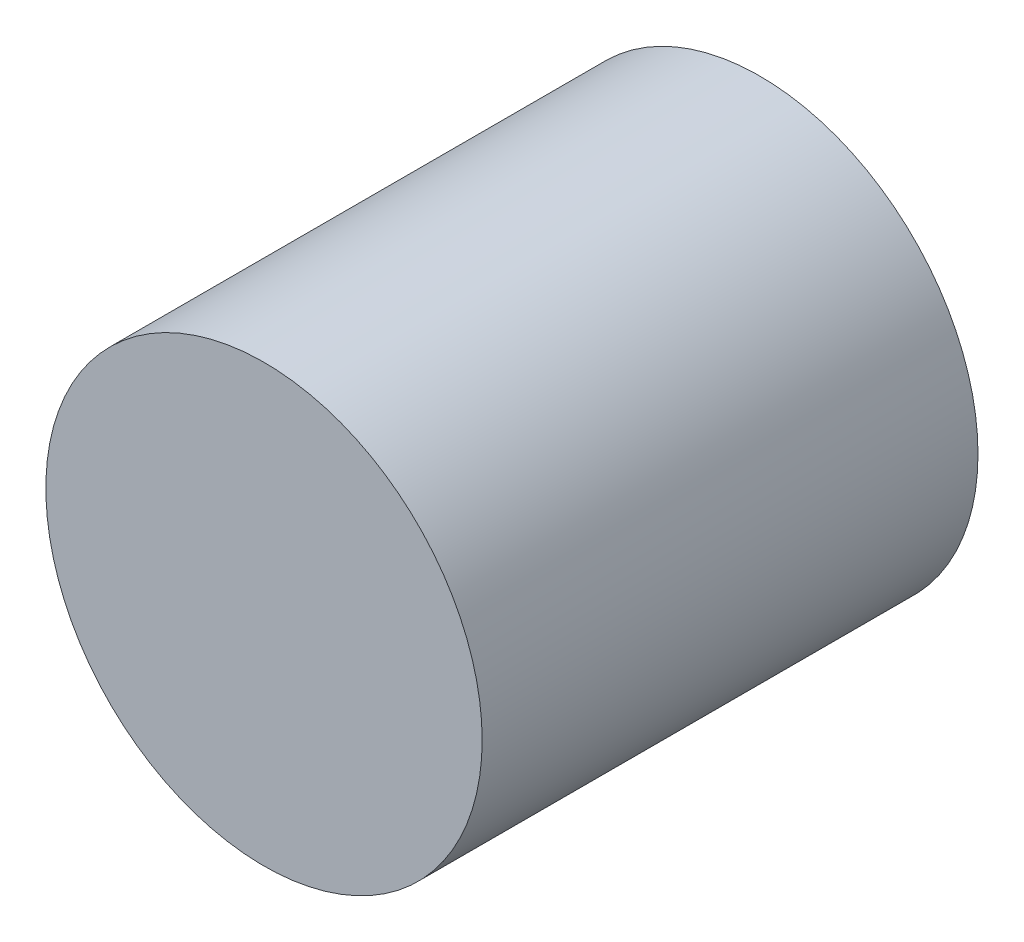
from build123d import *

# Parameters (mm, degrees)
ESQUISSE1_R      = 22
EXTRUSION1_DEPTH = 25


with BuildPart() as part:
    # Esquisse1 → Extrusion1 (new, symmetric)
    with BuildSketch(Plane.XY):
        with Locations((195.925625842, 0)):
            Circle(ESQUISSE1_R)
    extrude(amount=EXTRUSION1_DEPTH, both=True)


solid = part.part
